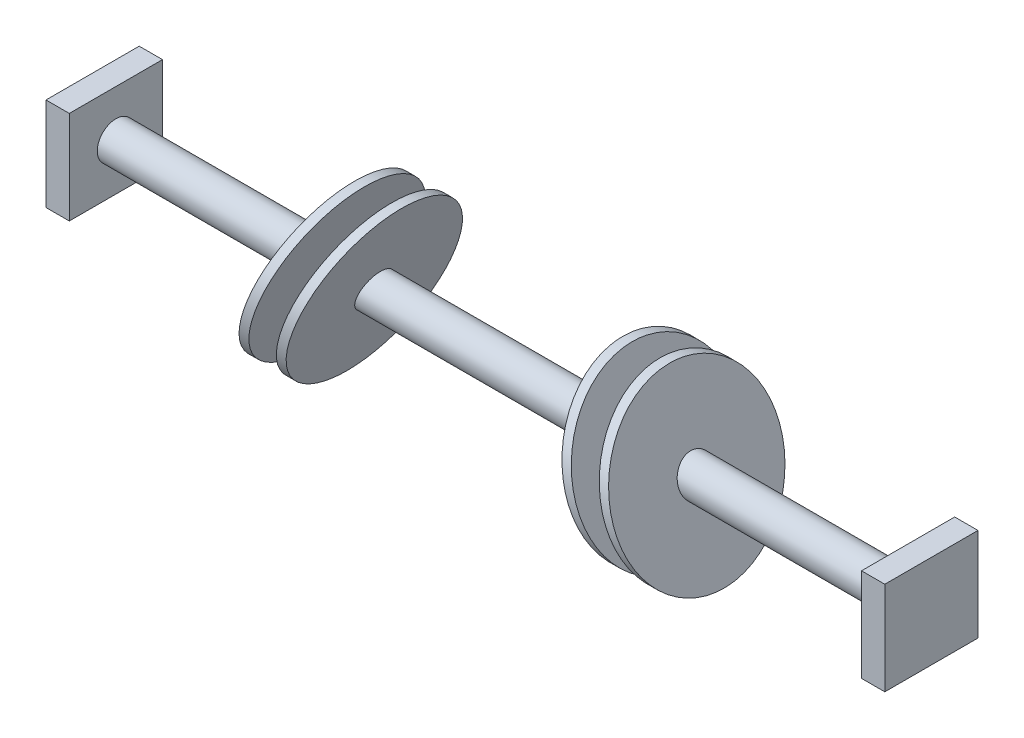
from build123d import *

# Parameters (mm, degrees)
SKETCH1_R                = 2
BOSS_EXTRUDE1_DEPTH      = 50
BOSS_EXTRUDE3_DEPTH      = 10
BOSS_EXTRUDE3_DEPTH_BACK = 10
BOSS_EXTRUDE4_DEPTH      = 10
BOSS_EXTRUDE4_DEPTH_BACK = 10
SKETCH4_W                = 23.317219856
SKETCH4_H                = 21.316267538
SKETCH4_R                = 9
CUT_EXTRUDE1_DEPTH       = 50
BOSS_EXTRUDE5_START      = 20
SKETCH5_R                = 2
BOSS_EXTRUDE5_DEPTH      = 20
SKETCH6_R                = 2
BOSS_EXTRUDE6_DEPTH      = 20
SKETCH7_W                = 10
SKETCH7_H                = 10
BOSS_EXTRUDE7_DEPTH      = 2.5
SKETCH8_W                = 10
SKETCH8_H                = 10
BOSS_EXTRUDE8_DEPTH      = 2.5


with BuildPart() as part:
    # Sketch1 → Boss-Extrude1 (new body)
    with BuildSketch(Plane(origin=(0, 0, 0), x_dir=(0, 0, -1), z_dir=(1, 0, 0))):
        Circle(SKETCH1_R)
    extrude(amount=BOSS_EXTRUDE1_DEPTH)

    # Sketch2 → Boss-Extrude3 (add, two sides: drawn at the far end of the back side and taken through both)
    with BuildSketch(Plane.XY.offset(-BOSS_EXTRUDE3_DEPTH_BACK)):
        Polygon((47.889629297, -9.429709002), (41.761832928, 9.429709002), (40.761832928, 9.429709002), (46.889629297, -9.429709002), align=None)
        Polygon((36.761832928, 9.429709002), (42.889629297, -9.429709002), (43.889629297, -9.429709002), (37.761832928, 9.429709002), align=None)
        Polygon((6.110370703, -9.429709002), (12.238167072, 9.429709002), (13.289629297, 9.429709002), (7.161832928, -9.429709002), align=None)
    extrude(amount=BOSS_EXTRUDE3_DEPTH + BOSS_EXTRUDE3_DEPTH_BACK)

    # Sketch3 → Boss-Extrude4 (add, two sides: drawn at the far end of the back side and taken through both)
    with BuildSketch(Plane.XY.offset(-BOSS_EXTRUDE4_DEPTH_BACK)):
        Polygon((9.289629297, 9.429709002), (3.161832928, -9.429709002), (2.110370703, -9.429709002), (8.238167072, 9.429709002), align=None)
    extrude(amount=BOSS_EXTRUDE4_DEPTH + BOSS_EXTRUDE4_DEPTH_BACK)

    # Sketch4 → Cut-Extrude1 (cut)
    with BuildSketch(Plane.ZY):
        Rectangle(SKETCH4_W, SKETCH4_H)
        with Locations(Location((0, 0, 0), (0, 0, 90))):
            Circle(SKETCH4_R, mode=Mode.SUBTRACT)
    extrude(amount=-CUT_EXTRUDE1_DEPTH, mode=Mode.SUBTRACT)

    # Sketch5 → Boss-Extrude5 (add)
    with BuildSketch(Plane.ZY.offset(BOSS_EXTRUDE5_START)):
        with Locations(Location((0, 0, 0), (0, 0, 90))):
            Circle(SKETCH5_R)
    extrude(amount=-BOSS_EXTRUDE5_DEPTH)

    # Sketch6 → Boss-Extrude6 (add)
    with BuildSketch(Plane(origin=(50, 0, 0), x_dir=(0, 0, -1), z_dir=(1, 0, 0))):
        with Locations(Location((0, 0, 0), (0, 0, 90))):
            Circle(SKETCH6_R)
    extrude(amount=BOSS_EXTRUDE6_DEPTH)

    # Sketch7 → Boss-Extrude7 (add)
    with BuildSketch(Plane.ZY.offset(20)):
        Rectangle(SKETCH7_W, SKETCH7_H)
    extrude(amount=-BOSS_EXTRUDE7_DEPTH)

    # Sketch8 → Boss-Extrude8 (add)
    with BuildSketch(Plane(origin=(70, 0, 0), x_dir=(0, 0, -1), z_dir=(1, 0, 0))):
        Rectangle(SKETCH8_W, SKETCH8_H)
    extrude(amount=-BOSS_EXTRUDE8_DEPTH)


solid = part.part
